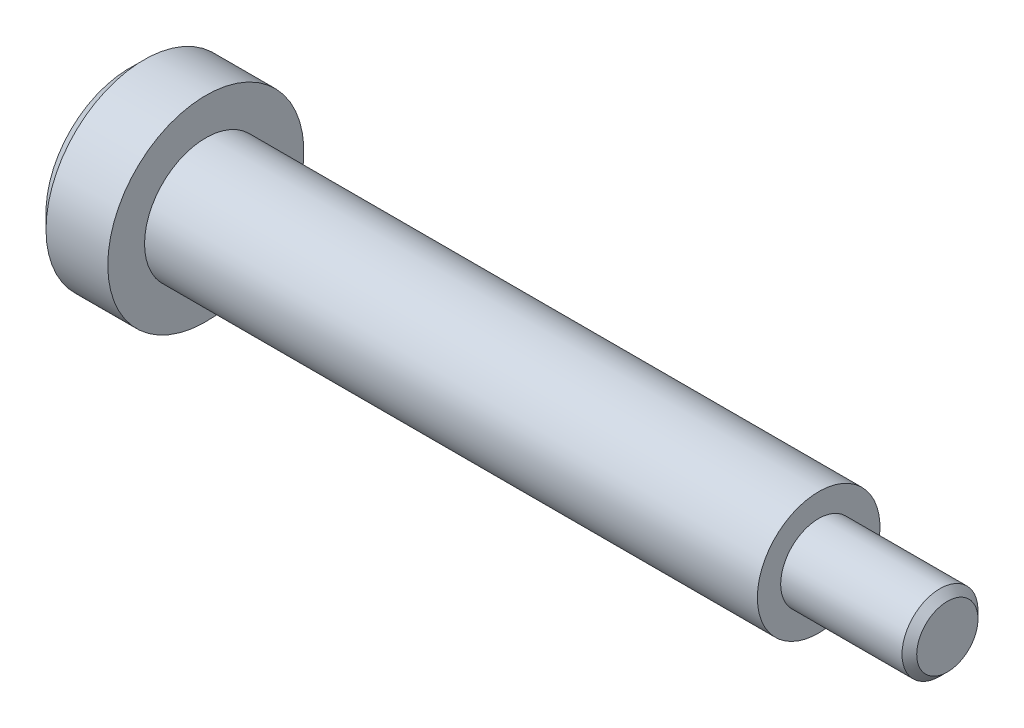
from build123d import *

# Parameters (mm, degrees)
CHAMFER1_SIZE = 1.524
CHAMFER2_SIZE = 0.762


with BuildPart() as part:
    # Sketch1 → Revolve1 (revolve)
    with BuildSketch(Plane.XY, mode=Mode.PRIVATE) as revolve1_sk:
        Polygon((-43.6499, 0), (-43.6499, 10.16), (-35.7251, 10.16), (-35.7251, 6.35), (27.7749, 6.35), (27.7749, 3.937), (41.1099, 3.937), (41.1099, 0), align=None)
    revolve(revolve1_sk.sketch.rotate(Axis((-46.865759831, 0, 0), (1, 0, 0)), 90), axis=Axis((-46.865759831, 0, 0), (1, 0, 0)))

    # Chamfer1
    chamfer1_edges = [part.edges().sort_by_distance(p)[0] for p in [
        (-43.6499, 0, -10.16),
    ]]
    chamfer(chamfer1_edges, length=CHAMFER1_SIZE)

    # Chamfer2
    chamfer2_edges = [part.edges().sort_by_distance(p)[0] for p in [
        (41.1099, 0, -3.937),
    ]]
    chamfer(chamfer2_edges, length=CHAMFER2_SIZE)


solid = part.part
